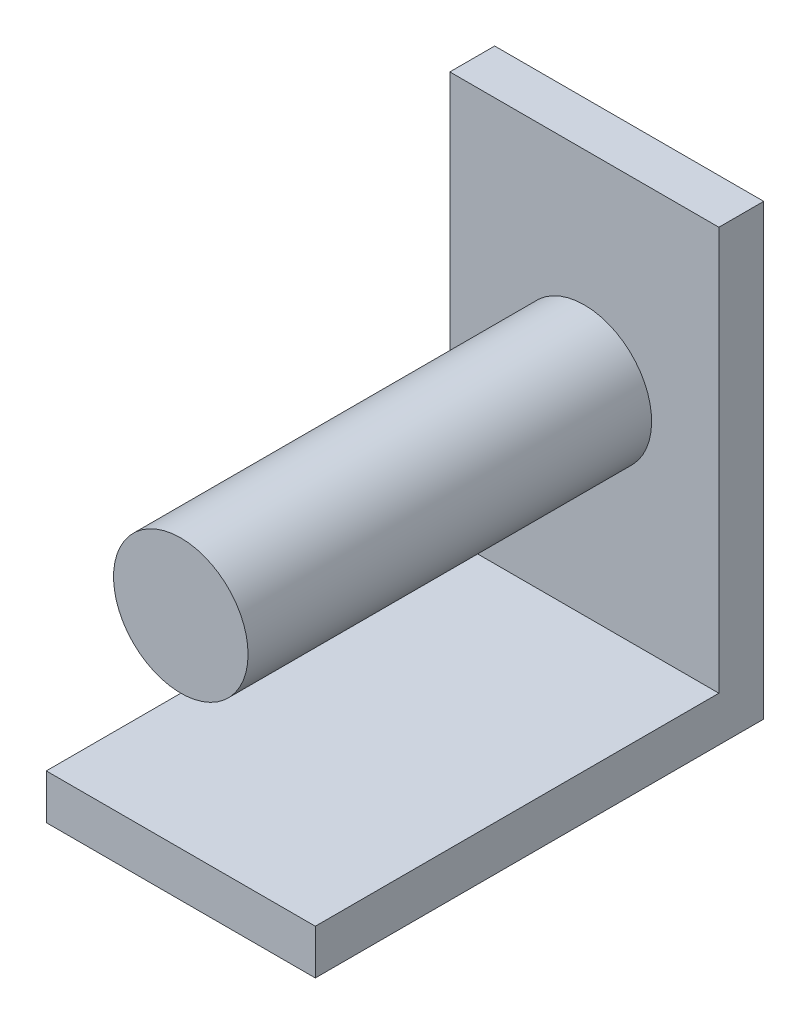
from build123d import *

# Parameters (mm, degrees)
EXTRUDE1_DEPTH = 15
SKETCH2_R      = 7.5
EXTRUDE2_DEPTH = 45


with BuildPart() as part:
    # Sketch1 → Extrude1 (new, symmetric)
    with BuildSketch(Plane(origin=(0, 0, 0), x_dir=(0, 0, -1), z_dir=(1, 0, 0))):
        Polygon((0, 0), (50, 0), (50, 50), (45, 50), (45, 5), (0, 5), align=None)
    extrude(amount=EXTRUDE1_DEPTH, both=True)

    # Sketch2 → Extrude2 (add, through all)
    with BuildSketch(Plane.XY.offset(-45)):
        with Locations(Location((0, 27.5, 0), (0, 0, 90))):
            Circle(SKETCH2_R)
    extrude(amount=EXTRUDE2_DEPTH)


solid = part.part
